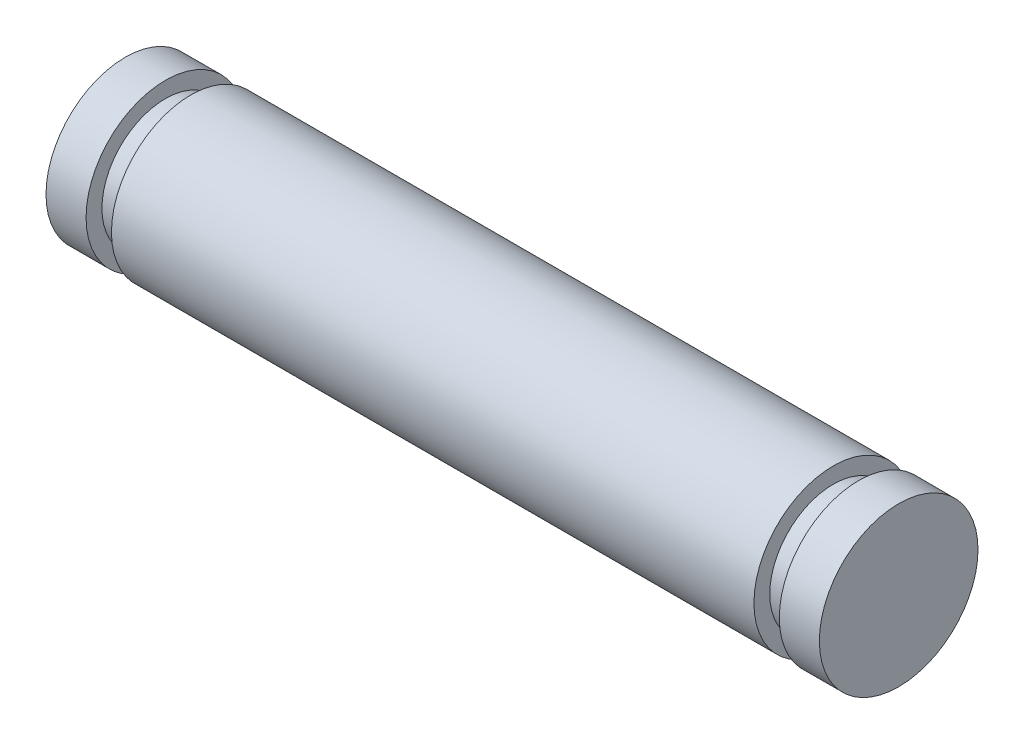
from build123d import *

# Parameters (mm, degrees)
SKETCH1_R           = 2
BOSS_EXTRUDE1_DEPTH = 9.75
SKETCH2_W           = 0.64
SKETCH2_H           = 0.4


with BuildPart() as part:
    # Sketch1 → Boss-Extrude1 (new, symmetric)
    with BuildSketch(Plane(origin=(0, 0, 0), x_dir=(0, 0, -1), z_dir=(1, 0, 0))):
        Circle(SKETCH1_R)
    extrude(amount=BOSS_EXTRUDE1_DEPTH, both=True)

    # Sketch2 → Cut-Revolve1 (revolve, cut)
    with BuildSketch(Plane(origin=(0, 0, 0), x_dir=(1, 0, 0), z_dir=(0, 1, 0)), mode=Mode.PRIVATE) as cut_revolve1_sk:
        with Locations((-8.42, 1.8)):
            Rectangle(SKETCH2_W, SKETCH2_H)
    cut_revolve1 = revolve(cut_revolve1_sk.sketch.rotate(Axis((-10.725, 0, 0), (1, 0, 0)), 180), axis=Axis((-10.725, 0, 0), (1, 0, 0)), mode=Mode.SUBTRACT)

    # Mirror1: Cut-Revolve1 across plane
    add(cut_revolve1.mirror(Plane(origin=(0, 0, 0), x_dir=(0, 0, 1), z_dir=(1, 0, 0))), mode=Mode.SUBTRACT)


solid = part.part
